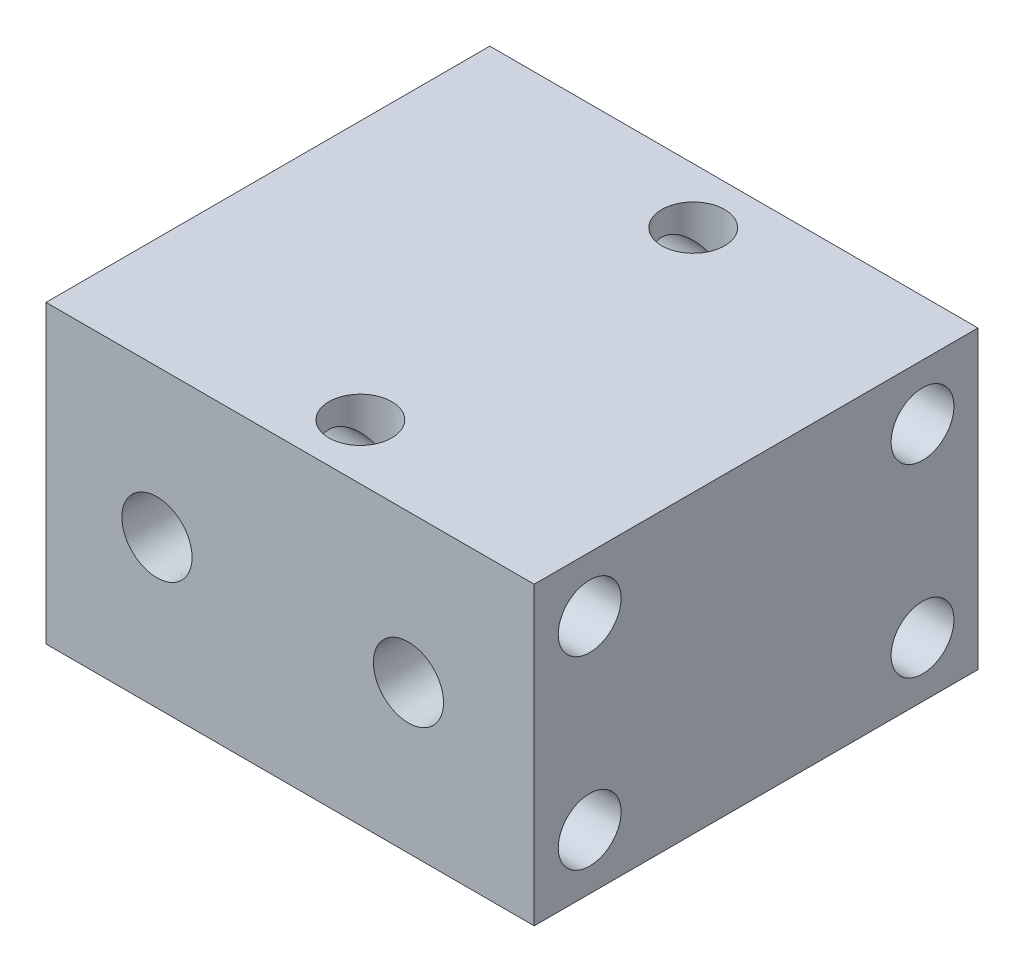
ISO-10303-21;
HEADER;
FILE_DESCRIPTION(('STEP AP214'),'2;1');
FILE_NAME('part.step','',(''),(''),'','','');
FILE_SCHEMA(('AUTOMOTIVE_DESIGN { 1 0 10303 214 1 1 1 1 }'));
ENDSEC;
DATA;
#1=APPLICATION_CONTEXT('core data for automotive mechanical design processes');
#2=APPLICATION_PROTOCOL_DEFINITION('international standard','automotive_design',2000,#1);
#3=PRODUCT_CONTEXT('',#1,'mechanical');
#4=PRODUCT('Part','Part','',(#3));
#5=PRODUCT_RELATED_PRODUCT_CATEGORY('part','',(#4));
#6=PRODUCT_DEFINITION_FORMATION('','',#4);
#7=PRODUCT_DEFINITION_CONTEXT('part definition',#1,'design');
#8=PRODUCT_DEFINITION('design','',#6,#7);
#9=PRODUCT_DEFINITION_SHAPE('','',#8);
#10=(LENGTH_UNIT() NAMED_UNIT(*) SI_UNIT(.MILLI.,.METRE.));
#11=(NAMED_UNIT(*) PLANE_ANGLE_UNIT() SI_UNIT($,.RADIAN.));
#12=(NAMED_UNIT(*) SI_UNIT($,.STERADIAN.) SOLID_ANGLE_UNIT());
#13=UNCERTAINTY_MEASURE_WITH_UNIT(LENGTH_MEASURE(1.E-05),#10,'distance_accuracy_value','');
#14=(GEOMETRIC_REPRESENTATION_CONTEXT(3) GLOBAL_UNCERTAINTY_ASSIGNED_CONTEXT((#13)) GLOBAL_UNIT_ASSIGNED_CONTEXT((#10,
#11,#12)) REPRESENTATION_CONTEXT('',''));
#15=CARTESIAN_POINT('',(0.,0.,0.));
#16=DIRECTION('',(0.,0.,1.));
#17=DIRECTION('',(1.,0.,0.));
#18=AXIS2_PLACEMENT_3D('',#15,#16,#17);
#19=CARTESIAN_POINT('',(2.00000000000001,40.,22.5));
#20=DIRECTION('',(0.,-1.,0.));
#21=DIRECTION('',(0.,0.,-1.));
#22=AXIS2_PLACEMENT_3D('',#19,#20,#21);
#23=CYLINDRICAL_SURFACE('',#22,4.25);
#24=CARTESIAN_POINT('',(2.00000000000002,7.49999999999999,22.5));
#25=DIRECTION('',(-0.707106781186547,-0.707106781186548,0.));
#26=DIRECTION('',(0.707106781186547,-0.707106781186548,0.));
#27=AXIS2_PLACEMENT_3D('',#24,#25,#26);
#28=ELLIPSE('',#27,6.01040764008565,4.25);
#29=CARTESIAN_POINT('',(2.00000000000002,7.49999999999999,18.25));
#30=VERTEX_POINT('',#29);
#31=CARTESIAN_POINT('',(2.00000000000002,7.49999999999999,26.75));
#32=VERTEX_POINT('',#31);
#33=EDGE_CURVE('E11',#30,#32,#28,.F.);
#34=ORIENTED_EDGE('',*,*,#33,.F.);
#35=CARTESIAN_POINT('',(2.00000000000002,7.49999999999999,22.5));
#36=DIRECTION('',(0.707106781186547,-0.707106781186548,0.));
#37=DIRECTION('',(-0.707106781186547,-0.707106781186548,0.));
#38=AXIS2_PLACEMENT_3D('',#35,#36,#37);
#39=ELLIPSE('',#38,6.01040764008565,4.25);
#40=EDGE_CURVE('E52',#32,#30,#39,.F.);
#41=ORIENTED_EDGE('',*,*,#40,.F.);
#42=EDGE_LOOP('',(#34,#41));
#43=FACE_BOUND('',#42,.T.);
#44=CARTESIAN_POINT('',(2.00000000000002,32.5,22.5));
#45=DIRECTION('',(-0.707106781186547,-0.707106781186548,0.));
#46=DIRECTION('',(0.707106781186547,-0.707106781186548,0.));
#47=AXIS2_PLACEMENT_3D('',#44,#45,#46);
#48=ELLIPSE('',#47,6.01040764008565,4.25);
#49=CARTESIAN_POINT('',(2.00000000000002,32.5,18.25));
#50=VERTEX_POINT('',#49);
#51=CARTESIAN_POINT('',(2.00000000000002,32.5,26.75));
#52=VERTEX_POINT('',#51);
#53=EDGE_CURVE('E121',#50,#52,#48,.T.);
#54=ORIENTED_EDGE('',*,*,#53,.F.);
#55=CARTESIAN_POINT('',(2.00000000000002,32.5,22.5));
#56=DIRECTION('',(0.707106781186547,-0.707106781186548,0.));
#57=DIRECTION('',(-0.707106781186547,-0.707106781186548,0.));
#58=AXIS2_PLACEMENT_3D('',#55,#56,#57);
#59=ELLIPSE('',#58,6.01040764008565,4.25);
#60=EDGE_CURVE('E123',#52,#50,#59,.T.);
#61=ORIENTED_EDGE('',*,*,#60,.F.);
#62=EDGE_LOOP('',(#54,#61));
#63=FACE_BOUND('',#62,.T.);
#64=ADVANCED_FACE('F38',(#43,#63),#23,.F.);
#65=CARTESIAN_POINT('',(2.00000000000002,32.5,22.5));
#66=DIRECTION('',(-0.707106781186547,-0.707106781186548,0.));
#67=DIRECTION('',(0.707106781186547,-0.707106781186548,0.));
#68=AXIS2_PLACEMENT_3D('',#65,#66,#67);
#69=ELLIPSE('',#68,6.01040764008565,4.25);
#70=EDGE_CURVE('E113',#50,#52,#69,.F.);
#71=ORIENTED_EDGE('',*,*,#70,.F.);
#72=CARTESIAN_POINT('',(2.00000000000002,32.5,22.5));
#73=DIRECTION('',(0.707106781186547,-0.707106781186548,0.));
#74=DIRECTION('',(-0.707106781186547,-0.707106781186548,0.));
#75=AXIS2_PLACEMENT_3D('',#72,#73,#74);
#76=ELLIPSE('',#75,6.01040764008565,4.25);
#77=EDGE_CURVE('E59',#52,#50,#76,.F.);
#78=ORIENTED_EDGE('',*,*,#77,.F.);
#79=EDGE_LOOP('',(#71,#78));
#80=FACE_BOUND('',#79,.T.);
#81=CARTESIAN_POINT('',(2.00000000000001,40.,22.5));
#82=DIRECTION('',(0.,1.,0.));
#83=DIRECTION('',(0.,0.,1.));
#84=AXIS2_PLACEMENT_3D('',#81,#82,#83);
#85=CIRCLE('',#84,4.25);
#86=CARTESIAN_POINT('',(2.00000000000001,40.,26.75));
#87=VERTEX_POINT('',#86);
#88=EDGE_CURVE('E191',#87,#87,#85,.T.);
#89=ORIENTED_EDGE('',*,*,#88,.T.);
#90=EDGE_LOOP('',(#89));
#91=FACE_BOUND('',#90,.T.);
#92=ADVANCED_FACE('F302',(#80,#91),#23,.F.);
#93=CARTESIAN_POINT('',(2.00000000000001,40.,-22.5));
#94=DIRECTION('',(0.,-1.,0.));
#95=DIRECTION('',(0.,0.,-1.));
#96=AXIS2_PLACEMENT_3D('',#93,#94,#95);
#97=CYLINDRICAL_SURFACE('',#96,4.25);
#98=CARTESIAN_POINT('',(2.00000000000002,7.49999999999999,-22.5));
#99=DIRECTION('',(-0.707106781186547,-0.707106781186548,0.));
#100=DIRECTION('',(0.707106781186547,-0.707106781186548,0.));
#101=AXIS2_PLACEMENT_3D('',#98,#99,#100);
#102=ELLIPSE('',#101,6.01040764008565,4.25);
#103=CARTESIAN_POINT('',(2.00000000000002,7.49999999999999,-26.75));
#104=VERTEX_POINT('',#103);
#105=CARTESIAN_POINT('',(2.00000000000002,7.49999999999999,-18.25));
#106=VERTEX_POINT('',#105);
#107=EDGE_CURVE('E126',#104,#106,#102,.F.);
#108=ORIENTED_EDGE('',*,*,#107,.F.);
#109=CARTESIAN_POINT('',(2.00000000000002,7.49999999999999,-22.5));
#110=DIRECTION('',(0.707106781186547,-0.707106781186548,0.));
#111=DIRECTION('',(-0.707106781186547,-0.707106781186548,0.));
#112=AXIS2_PLACEMENT_3D('',#109,#110,#111);
#113=ELLIPSE('',#112,6.01040764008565,4.25);
#114=EDGE_CURVE('E134',#106,#104,#113,.F.);
#115=ORIENTED_EDGE('',*,*,#114,.F.);
#116=EDGE_LOOP('',(#108,#115));
#117=FACE_BOUND('',#116,.T.);
#118=CARTESIAN_POINT('',(2.00000000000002,32.5,-22.5));
#119=DIRECTION('',(-0.707106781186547,-0.707106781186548,0.));
#120=DIRECTION('',(0.707106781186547,-0.707106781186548,0.));
#121=AXIS2_PLACEMENT_3D('',#118,#119,#120);
#122=ELLIPSE('',#121,6.01040764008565,4.25);
#123=CARTESIAN_POINT('',(2.00000000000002,32.5,-26.75));
#124=VERTEX_POINT('',#123);
#125=CARTESIAN_POINT('',(2.00000000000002,32.5,-18.25));
#126=VERTEX_POINT('',#125);
#127=EDGE_CURVE('E140',#124,#126,#122,.T.);
#128=ORIENTED_EDGE('',*,*,#127,.F.);
#129=CARTESIAN_POINT('',(2.00000000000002,32.5,-22.5));
#130=DIRECTION('',(0.707106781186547,-0.707106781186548,0.));
#131=DIRECTION('',(-0.707106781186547,-0.707106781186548,0.));
#132=AXIS2_PLACEMENT_3D('',#129,#130,#131);
#133=ELLIPSE('',#132,6.01040764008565,4.25);
#134=EDGE_CURVE('E143',#126,#124,#133,.T.);
#135=ORIENTED_EDGE('',*,*,#134,.F.);
#136=EDGE_LOOP('',(#128,#135));
#137=FACE_BOUND('',#136,.T.);
#138=ADVANCED_FACE('F307',(#117,#137),#97,.F.);
#139=CARTESIAN_POINT('',(2.00000000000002,32.5,-22.5));
#140=DIRECTION('',(-0.707106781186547,-0.707106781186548,0.));
#141=DIRECTION('',(0.707106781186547,-0.707106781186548,0.));
#142=AXIS2_PLACEMENT_3D('',#139,#140,#141);
#143=ELLIPSE('',#142,6.01040764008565,4.25);
#144=EDGE_CURVE('E137',#124,#126,#143,.F.);
#145=ORIENTED_EDGE('',*,*,#144,.F.);
#146=CARTESIAN_POINT('',(2.00000000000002,32.5,-22.5));
#147=DIRECTION('',(0.707106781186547,-0.707106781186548,0.));
#148=DIRECTION('',(-0.707106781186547,-0.707106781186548,0.));
#149=AXIS2_PLACEMENT_3D('',#146,#147,#148);
#150=ELLIPSE('',#149,6.01040764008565,4.25);
#151=EDGE_CURVE('E145',#126,#124,#150,.F.);
#152=ORIENTED_EDGE('',*,*,#151,.F.);
#153=EDGE_LOOP('',(#145,#152));
#154=FACE_BOUND('',#153,.T.);
#155=CARTESIAN_POINT('',(2.00000000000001,40.,-22.5));
#156=DIRECTION('',(0.,1.,0.));
#157=DIRECTION('',(0.,0.,1.));
#158=AXIS2_PLACEMENT_3D('',#155,#156,#157);
#159=CIRCLE('',#158,4.25);
#160=CARTESIAN_POINT('',(2.00000000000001,40.,-18.25));
#161=VERTEX_POINT('',#160);
#162=EDGE_CURVE('E180',#161,#161,#159,.T.);
#163=ORIENTED_EDGE('',*,*,#162,.T.);
#164=EDGE_LOOP('',(#163));
#165=FACE_BOUND('',#164,.T.);
#166=ADVANCED_FACE('F319',(#154,#165),#97,.F.);
#167=CARTESIAN_POINT('',(-33.,40.,-30.));
#168=DIRECTION('',(0.,1.,0.));
#169=DIRECTION('',(0.,0.,1.));
#170=AXIS2_PLACEMENT_3D('',#167,#168,#169);
#171=PLANE('',#170);
#172=ORIENTED_EDGE('',*,*,#162,.F.);
#173=EDGE_LOOP('',(#172));
#174=FACE_BOUND('',#173,.T.);
#175=DIRECTION('',(0.,0.,1.));
#176=VECTOR('',#175,1.);
#177=CARTESIAN_POINT('',(-33.,40.,-30.));
#178=LINE('',#177,#176);
#179=CARTESIAN_POINT('',(-33.,40.,-30.));
#180=VERTEX_POINT('',#179);
#181=CARTESIAN_POINT('',(-33.,40.,30.));
#182=VERTEX_POINT('',#181);
#183=EDGE_CURVE('E172',#180,#182,#178,.T.);
#184=ORIENTED_EDGE('',*,*,#183,.T.);
#185=DIRECTION('',(1.,0.,0.));
#186=VECTOR('',#185,1.);
#187=CARTESIAN_POINT('',(-33.,40.,30.));
#188=LINE('',#187,#186);
#189=CARTESIAN_POINT('',(33.,40.,30.));
#190=VERTEX_POINT('',#189);
#191=EDGE_CURVE('E184',#182,#190,#188,.T.);
#192=ORIENTED_EDGE('',*,*,#191,.T.);
#193=DIRECTION('',(0.,0.,-1.));
#194=VECTOR('',#193,1.);
#195=CARTESIAN_POINT('',(33.,40.,-30.));
#196=LINE('',#195,#194);
#197=CARTESIAN_POINT('',(33.,40.,-30.));
#198=VERTEX_POINT('',#197);
#199=EDGE_CURVE('E182',#190,#198,#196,.T.);
#200=ORIENTED_EDGE('',*,*,#199,.T.);
#201=DIRECTION('',(-1.,0.,0.));
#202=VECTOR('',#201,1.);
#203=CARTESIAN_POINT('',(-33.,40.,-30.));
#204=LINE('',#203,#202);
#205=EDGE_CURVE('E169',#198,#180,#204,.T.);
#206=ORIENTED_EDGE('',*,*,#205,.T.);
#207=EDGE_LOOP('',(#184,#192,#200,#206));
#208=FACE_BOUND('',#207,.T.);
#209=ORIENTED_EDGE('',*,*,#88,.F.);
#210=EDGE_LOOP('',(#209));
#211=FACE_BOUND('',#210,.T.);
#212=ADVANCED_FACE('F281',(#174,#208,#211),#171,.T.);
#213=CARTESIAN_POINT('',(-33.,0.,-30.));
#214=DIRECTION('',(0.,1.,0.));
#215=DIRECTION('',(0.,0.,1.));
#216=AXIS2_PLACEMENT_3D('',#213,#214,#215);
#217=PLANE('',#216);
#218=CARTESIAN_POINT('',(2.00000000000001,0.,-22.5));
#219=DIRECTION('',(0.,1.,0.));
#220=DIRECTION('',(0.,0.,1.));
#221=AXIS2_PLACEMENT_3D('',#218,#219,#220);
#222=CIRCLE('',#221,4.25);
#223=CARTESIAN_POINT('',(2.00000000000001,0.,-18.25));
#224=VERTEX_POINT('',#223);
#225=EDGE_CURVE('E188',#224,#224,#222,.T.);
#226=ORIENTED_EDGE('',*,*,#225,.T.);
#227=EDGE_LOOP('',(#226));
#228=FACE_BOUND('',#227,.T.);
#229=DIRECTION('',(0.,0.,1.));
#230=VECTOR('',#229,1.);
#231=CARTESIAN_POINT('',(-33.,0.,-30.));
#232=LINE('',#231,#230);
#233=CARTESIAN_POINT('',(-33.,0.,-30.));
#234=VERTEX_POINT('',#233);
#235=CARTESIAN_POINT('',(-33.,0.,30.));
#236=VERTEX_POINT('',#235);
#237=EDGE_CURVE('E177',#234,#236,#232,.T.);
#238=ORIENTED_EDGE('',*,*,#237,.F.);
#239=DIRECTION('',(-1.,0.,0.));
#240=VECTOR('',#239,1.);
#241=CARTESIAN_POINT('',(-33.,0.,-30.));
#242=LINE('',#241,#240);
#243=CARTESIAN_POINT('',(33.,0.,-30.));
#244=VERTEX_POINT('',#243);
#245=EDGE_CURVE('E170',#244,#234,#242,.T.);
#246=ORIENTED_EDGE('',*,*,#245,.F.);
#247=DIRECTION('',(0.,0.,-1.));
#248=VECTOR('',#247,1.);
#249=CARTESIAN_POINT('',(33.,0.,-30.));
#250=LINE('',#249,#248);
#251=CARTESIAN_POINT('',(33.,0.,30.));
#252=VERTEX_POINT('',#251);
#253=EDGE_CURVE('E173',#252,#244,#250,.T.);
#254=ORIENTED_EDGE('',*,*,#253,.F.);
#255=DIRECTION('',(1.,0.,0.));
#256=VECTOR('',#255,1.);
#257=CARTESIAN_POINT('',(-33.,0.,30.));
#258=LINE('',#257,#256);
#259=EDGE_CURVE('E175',#236,#252,#258,.T.);
#260=ORIENTED_EDGE('',*,*,#259,.F.);
#261=EDGE_LOOP('',(#238,#246,#254,#260));
#262=FACE_BOUND('',#261,.T.);
#263=CARTESIAN_POINT('',(2.00000000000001,0.,22.5));
#264=DIRECTION('',(0.,1.,0.));
#265=DIRECTION('',(0.,0.,1.));
#266=AXIS2_PLACEMENT_3D('',#263,#264,#265);
#267=CIRCLE('',#266,4.25);
#268=CARTESIAN_POINT('',(2.00000000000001,0.,26.75));
#269=VERTEX_POINT('',#268);
#270=EDGE_CURVE('E194',#269,#269,#267,.T.);
#271=ORIENTED_EDGE('',*,*,#270,.T.);
#272=EDGE_LOOP('',(#271));
#273=FACE_BOUND('',#272,.T.);
#274=ADVANCED_FACE('F260',(#228,#262,#273),#217,.F.);
#275=CARTESIAN_POINT('',(-33.,40.,-30.));
#276=DIRECTION('',(1.,0.,0.));
#277=DIRECTION('',(0.,0.,-1.));
#278=AXIS2_PLACEMENT_3D('',#275,#276,#277);
#279=PLANE('',#278);
#280=CARTESIAN_POINT('',(-33.,7.5,22.5));
#281=DIRECTION('',(-1.,0.,0.));
#282=DIRECTION('',(0.,0.,1.));
#283=AXIS2_PLACEMENT_3D('',#280,#281,#282);
#284=CIRCLE('',#283,4.25);
#285=CARTESIAN_POINT('',(-33.,7.5,26.75));
#286=VERTEX_POINT('',#285);
#287=EDGE_CURVE('E253',#286,#286,#284,.T.);
#288=ORIENTED_EDGE('',*,*,#287,.F.);
#289=EDGE_LOOP('',(#288));
#290=FACE_BOUND('',#289,.T.);
#291=CARTESIAN_POINT('',(-33.,32.5,22.5));
#292=DIRECTION('',(-1.,0.,0.));
#293=DIRECTION('',(0.,0.,1.));
#294=AXIS2_PLACEMENT_3D('',#291,#292,#293);
#295=CIRCLE('',#294,4.25);
#296=CARTESIAN_POINT('',(-33.,32.5,26.75));
#297=VERTEX_POINT('',#296);
#298=EDGE_CURVE('E247',#297,#297,#295,.T.);
#299=ORIENTED_EDGE('',*,*,#298,.F.);
#300=EDGE_LOOP('',(#299));
#301=FACE_BOUND('',#300,.T.);
#302=CARTESIAN_POINT('',(-33.,7.5,-22.5));
#303=DIRECTION('',(-1.,0.,0.));
#304=DIRECTION('',(0.,0.,1.));
#305=AXIS2_PLACEMENT_3D('',#302,#303,#304);
#306=CIRCLE('',#305,4.25);
#307=CARTESIAN_POINT('',(-33.,7.5,-18.25));
#308=VERTEX_POINT('',#307);
#309=EDGE_CURVE('E241',#308,#308,#306,.T.);
#310=ORIENTED_EDGE('',*,*,#309,.F.);
#311=EDGE_LOOP('',(#310));
#312=FACE_BOUND('',#311,.T.);
#313=CARTESIAN_POINT('',(-33.,32.5,-22.5));
#314=DIRECTION('',(-1.,0.,0.));
#315=DIRECTION('',(0.,0.,1.));
#316=AXIS2_PLACEMENT_3D('',#313,#314,#315);
#317=CIRCLE('',#316,4.25);
#318=CARTESIAN_POINT('',(-33.,32.5,-18.25));
#319=VERTEX_POINT('',#318);
#320=EDGE_CURVE('E235',#319,#319,#317,.T.);
#321=ORIENTED_EDGE('',*,*,#320,.F.);
#322=EDGE_LOOP('',(#321));
#323=FACE_BOUND('',#322,.T.);
#324=CARTESIAN_POINT('',(-33.,20.,0.));
#325=DIRECTION('',(-1.,0.,0.));
#326=DIRECTION('',(0.,0.,1.));
#327=AXIS2_PLACEMENT_3D('',#324,#325,#326);
#328=CIRCLE('',#327,0.5);
#329=CARTESIAN_POINT('',(-33.,20.,0.500000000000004));
#330=VERTEX_POINT('',#329);
#331=EDGE_CURVE('E200',#330,#330,#328,.T.);
#332=ORIENTED_EDGE('',*,*,#331,.F.);
#333=EDGE_LOOP('',(#332));
#334=FACE_BOUND('',#333,.T.);
#335=ORIENTED_EDGE('',*,*,#237,.T.);
#336=DIRECTION('',(0.,-1.,0.));
#337=VECTOR('',#336,1.);
#338=CARTESIAN_POINT('',(-33.,40.,30.));
#339=LINE('',#338,#337);
#340=EDGE_CURVE('E148',#182,#236,#339,.T.);
#341=ORIENTED_EDGE('',*,*,#340,.F.);
#342=ORIENTED_EDGE('',*,*,#183,.F.);
#343=DIRECTION('',(0.,-1.,0.));
#344=VECTOR('',#343,1.);
#345=CARTESIAN_POINT('',(-33.,40.,-30.));
#346=LINE('',#345,#344);
#347=EDGE_CURVE('E166',#180,#234,#346,.T.);
#348=ORIENTED_EDGE('',*,*,#347,.T.);
#349=EDGE_LOOP('',(#335,#341,#342,#348));
#350=FACE_BOUND('',#349,.T.);
#351=ADVANCED_FACE('F40',(#290,#301,#312,#323,#334,#350),#279,.F.);
#352=CARTESIAN_POINT('',(-33.,40.,30.));
#353=DIRECTION('',(0.,0.,-1.));
#354=DIRECTION('',(-1.,0.,0.));
#355=AXIS2_PLACEMENT_3D('',#352,#353,#354);
#356=PLANE('',#355);
#357=CARTESIAN_POINT('',(16.,20.,30.));
#358=DIRECTION('',(0.,0.,1.));
#359=DIRECTION('',(1.,0.,0.));
#360=AXIS2_PLACEMENT_3D('',#357,#358,#359);
#361=CIRCLE('',#360,4.744593);
#362=CARTESIAN_POINT('',(20.744593,20.,30.));
#363=VERTEX_POINT('',#362);
#364=EDGE_CURVE('E157',#363,#363,#361,.T.);
#365=ORIENTED_EDGE('',*,*,#364,.F.);
#366=EDGE_LOOP('',(#365));
#367=FACE_BOUND('',#366,.T.);
#368=CARTESIAN_POINT('',(-18.,20.,30.));
#369=DIRECTION('',(0.,0.,1.));
#370=DIRECTION('',(1.,0.,0.));
#371=AXIS2_PLACEMENT_3D('',#368,#369,#370);
#372=CIRCLE('',#371,4.744593);
#373=CARTESIAN_POINT('',(-13.255407,20.,30.));
#374=VERTEX_POINT('',#373);
#375=EDGE_CURVE('E214',#374,#374,#372,.T.);
#376=ORIENTED_EDGE('',*,*,#375,.F.);
#377=EDGE_LOOP('',(#376));
#378=FACE_BOUND('',#377,.T.);
#379=ORIENTED_EDGE('',*,*,#259,.T.);
#380=DIRECTION('',(0.,-1.,0.));
#381=VECTOR('',#380,1.);
#382=CARTESIAN_POINT('',(33.,40.,30.));
#383=LINE('',#382,#381);
#384=EDGE_CURVE('E160',#190,#252,#383,.T.);
#385=ORIENTED_EDGE('',*,*,#384,.F.);
#386=ORIENTED_EDGE('',*,*,#191,.F.);
#387=ORIENTED_EDGE('',*,*,#340,.T.);
#388=EDGE_LOOP('',(#379,#385,#386,#387));
#389=FACE_BOUND('',#388,.T.);
#390=ADVANCED_FACE('F259',(#367,#378,#389),#356,.F.);
#391=CARTESIAN_POINT('',(33.,40.,-30.));
#392=DIRECTION('',(-1.,0.,0.));
#393=DIRECTION('',(0.,0.,1.));
#394=AXIS2_PLACEMENT_3D('',#391,#392,#393);
#395=PLANE('',#394);
#396=CARTESIAN_POINT('',(33.,7.5,22.5));
#397=DIRECTION('',(-1.,0.,0.));
#398=DIRECTION('',(0.,0.,1.));
#399=AXIS2_PLACEMENT_3D('',#396,#397,#398);
#400=CIRCLE('',#399,4.25);
#401=CARTESIAN_POINT('',(33.,7.5,26.75));
#402=VERTEX_POINT('',#401);
#403=EDGE_CURVE('E250',#402,#402,#400,.F.);
#404=ORIENTED_EDGE('',*,*,#403,.F.);
#405=EDGE_LOOP('',(#404));
#406=FACE_BOUND('',#405,.T.);
#407=CARTESIAN_POINT('',(33.,32.5,22.5));
#408=DIRECTION('',(-1.,0.,0.));
#409=DIRECTION('',(0.,0.,1.));
#410=AXIS2_PLACEMENT_3D('',#407,#408,#409);
#411=CIRCLE('',#410,4.25);
#412=CARTESIAN_POINT('',(33.,32.5,26.75));
#413=VERTEX_POINT('',#412);
#414=EDGE_CURVE('E244',#413,#413,#411,.F.);
#415=ORIENTED_EDGE('',*,*,#414,.F.);
#416=EDGE_LOOP('',(#415));
#417=FACE_BOUND('',#416,.T.);
#418=CARTESIAN_POINT('',(33.,7.5,-22.5));
#419=DIRECTION('',(-1.,0.,0.));
#420=DIRECTION('',(0.,0.,1.));
#421=AXIS2_PLACEMENT_3D('',#418,#419,#420);
#422=CIRCLE('',#421,4.25);
#423=CARTESIAN_POINT('',(33.,7.5,-18.25));
#424=VERTEX_POINT('',#423);
#425=EDGE_CURVE('E238',#424,#424,#422,.F.);
#426=ORIENTED_EDGE('',*,*,#425,.F.);
#427=EDGE_LOOP('',(#426));
#428=FACE_BOUND('',#427,.T.);
#429=CARTESIAN_POINT('',(33.,32.5,-22.5));
#430=DIRECTION('',(-1.,0.,0.));
#431=DIRECTION('',(0.,0.,1.));
#432=AXIS2_PLACEMENT_3D('',#429,#430,#431);
#433=CIRCLE('',#432,4.25);
#434=CARTESIAN_POINT('',(33.,32.5,-18.25));
#435=VERTEX_POINT('',#434);
#436=EDGE_CURVE('E232',#435,#435,#433,.F.);
#437=ORIENTED_EDGE('',*,*,#436,.F.);
#438=EDGE_LOOP('',(#437));
#439=FACE_BOUND('',#438,.T.);
#440=ORIENTED_EDGE('',*,*,#253,.T.);
#441=DIRECTION('',(0.,-1.,0.));
#442=VECTOR('',#441,1.);
#443=CARTESIAN_POINT('',(33.,40.,-30.));
#444=LINE('',#443,#442);
#445=EDGE_CURVE('E163',#198,#244,#444,.T.);
#446=ORIENTED_EDGE('',*,*,#445,.F.);
#447=ORIENTED_EDGE('',*,*,#199,.F.);
#448=ORIENTED_EDGE('',*,*,#384,.T.);
#449=EDGE_LOOP('',(#440,#446,#447,#448));
#450=FACE_BOUND('',#449,.T.);
#451=ADVANCED_FACE('F288',(#406,#417,#428,#439,#450),#395,.F.);
#452=CARTESIAN_POINT('',(-33.,40.,-30.));
#453=DIRECTION('',(0.,0.,1.));
#454=DIRECTION('',(1.,0.,0.));
#455=AXIS2_PLACEMENT_3D('',#452,#453,#454);
#456=PLANE('',#455);
#457=ORIENTED_EDGE('',*,*,#245,.T.);
#458=ORIENTED_EDGE('',*,*,#347,.F.);
#459=ORIENTED_EDGE('',*,*,#205,.F.);
#460=ORIENTED_EDGE('',*,*,#445,.T.);
#461=EDGE_LOOP('',(#457,#458,#459,#460));
#462=FACE_BOUND('',#461,.T.);
#463=ADVANCED_FACE('F286',(#462),#456,.F.);
#464=CARTESIAN_POINT('',(2.00000000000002,7.49999999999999,-22.5));
#465=DIRECTION('',(-0.707106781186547,-0.707106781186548,0.));
#466=DIRECTION('',(0.707106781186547,-0.707106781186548,0.));
#467=AXIS2_PLACEMENT_3D('',#464,#465,#466);
#468=ELLIPSE('',#467,6.01040764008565,4.25);
#469=EDGE_CURVE('E129',#104,#106,#468,.T.);
#470=ORIENTED_EDGE('',*,*,#469,.F.);
#471=CARTESIAN_POINT('',(2.00000000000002,7.49999999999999,-22.5));
#472=DIRECTION('',(0.707106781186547,-0.707106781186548,0.));
#473=DIRECTION('',(-0.707106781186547,-0.707106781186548,0.));
#474=AXIS2_PLACEMENT_3D('',#471,#472,#473);
#475=ELLIPSE('',#474,6.01040764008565,4.25);
#476=EDGE_CURVE('E132',#106,#104,#475,.T.);
#477=ORIENTED_EDGE('',*,*,#476,.F.);
#478=EDGE_LOOP('',(#470,#477));
#479=FACE_BOUND('',#478,.T.);
#480=ORIENTED_EDGE('',*,*,#225,.F.);
#481=EDGE_LOOP('',(#480));
#482=FACE_BOUND('',#481,.T.);
#483=ADVANCED_FACE('F296',(#479,#482),#97,.F.);
#484=CARTESIAN_POINT('',(2.00000000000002,7.49999999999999,22.5));
#485=DIRECTION('',(-0.707106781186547,-0.707106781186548,0.));
#486=DIRECTION('',(0.707106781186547,-0.707106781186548,0.));
#487=AXIS2_PLACEMENT_3D('',#484,#485,#486);
#488=ELLIPSE('',#487,6.01040764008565,4.25);
#489=EDGE_CURVE('E46',#30,#32,#488,.T.);
#490=ORIENTED_EDGE('',*,*,#489,.F.);
#491=CARTESIAN_POINT('',(2.00000000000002,7.49999999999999,22.5));
#492=DIRECTION('',(0.707106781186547,-0.707106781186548,0.));
#493=DIRECTION('',(-0.707106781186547,-0.707106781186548,0.));
#494=AXIS2_PLACEMENT_3D('',#491,#492,#493);
#495=ELLIPSE('',#494,6.01040764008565,4.25);
#496=EDGE_CURVE('E104',#32,#30,#495,.T.);
#497=ORIENTED_EDGE('',*,*,#496,.F.);
#498=EDGE_LOOP('',(#490,#497));
#499=FACE_BOUND('',#498,.T.);
#500=ORIENTED_EDGE('',*,*,#270,.F.);
#501=EDGE_LOOP('',(#500));
#502=FACE_BOUND('',#501,.T.);
#503=ADVANCED_FACE('F116',(#499,#502),#23,.F.);
#504=CARTESIAN_POINT('',(-23.,20.,0.));
#505=DIRECTION('',(-1.,0.,0.));
#506=DIRECTION('',(0.,0.,1.));
#507=AXIS2_PLACEMENT_3D('',#504,#505,#506);
#508=CYLINDRICAL_SURFACE('',#507,0.5);
#509=CARTESIAN_POINT('',(-23.,20.,0.));
#510=DIRECTION('',(-1.,0.,0.));
#511=DIRECTION('',(0.,0.,1.));
#512=AXIS2_PLACEMENT_3D('',#509,#510,#511);
#513=CIRCLE('',#512,0.5);
#514=CARTESIAN_POINT('',(-23.,20.,0.500000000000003));
#515=VERTEX_POINT('',#514);
#516=EDGE_CURVE('E197',#515,#515,#513,.T.);
#517=ORIENTED_EDGE('',*,*,#516,.F.);
#518=EDGE_LOOP('',(#517));
#519=FACE_BOUND('',#518,.T.);
#520=ORIENTED_EDGE('',*,*,#331,.T.);
#521=EDGE_LOOP('',(#520));
#522=FACE_BOUND('',#521,.T.);
#523=ADVANCED_FACE('F311',(#519,#522),#508,.F.);
#524=CARTESIAN_POINT('',(-23.,20.,0.));
#525=DIRECTION('',(-1.,0.,0.));
#526=DIRECTION('',(0.,0.,1.));
#527=AXIS2_PLACEMENT_3D('',#524,#525,#526);
#528=PLANE('',#527);
#529=ORIENTED_EDGE('',*,*,#516,.T.);
#530=EDGE_LOOP('',(#529));
#531=FACE_BOUND('',#530,.T.);
#532=ADVANCED_FACE('F316',(#531),#528,.T.);
#533=CARTESIAN_POINT('',(-18.,20.,18.38));
#534=DIRECTION('',(0.,0.,1.));
#535=DIRECTION('',(1.,0.,0.));
#536=AXIS2_PLACEMENT_3D('',#533,#534,#535);
#537=CONICAL_SURFACE('',#536,4.21640000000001,1.02974425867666);
#538=CARTESIAN_POINT('',(-18.,20.,17.0482525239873));
#539=DIRECTION('',(0.,0.,1.));
#540=DIRECTION('',(1.,0.,0.));
#541=AXIS2_PLACEMENT_3D('',#538,#539,#540);
#542=CIRCLE('',#541,2.);
#543=CARTESIAN_POINT('',(-16.,20.,17.0482525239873));
#544=VERTEX_POINT('',#543);
#545=EDGE_CURVE('E154',#544,#544,#542,.F.);
#546=ORIENTED_EDGE('',*,*,#545,.T.);
#547=EDGE_LOOP('',(#546));
#548=FACE_BOUND('',#547,.T.);
#549=CARTESIAN_POINT('',(-18.,20.,18.38));
#550=DIRECTION('',(0.,0.,1.));
#551=DIRECTION('',(1.,0.,0.));
#552=AXIS2_PLACEMENT_3D('',#549,#550,#551);
#553=CIRCLE('',#552,4.21640000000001);
#554=CARTESIAN_POINT('',(-13.7836,20.,18.38));
#555=VERTEX_POINT('',#554);
#556=EDGE_CURVE('E203',#555,#555,#553,.T.);
#557=ORIENTED_EDGE('',*,*,#556,.T.);
#558=EDGE_LOOP('',(#557));
#559=FACE_BOUND('',#558,.T.);
#560=ADVANCED_FACE('F399',(#548,#559),#537,.F.);
#561=CARTESIAN_POINT('',(-18.,20.,30.));
#562=DIRECTION('',(0.,0.,1.));
#563=DIRECTION('',(1.,0.,0.));
#564=AXIS2_PLACEMENT_3D('',#561,#562,#563);
#565=CYLINDRICAL_SURFACE('',#564,4.21640000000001);
#566=ORIENTED_EDGE('',*,*,#556,.F.);
#567=EDGE_LOOP('',(#566));
#568=FACE_BOUND('',#567,.T.);
#569=CARTESIAN_POINT('',(-18.,20.,23.08));
#570=DIRECTION('',(0.,0.,1.));
#571=DIRECTION('',(1.,0.,0.));
#572=AXIS2_PLACEMENT_3D('',#569,#570,#571);
#573=CIRCLE('',#572,4.2164);
#574=CARTESIAN_POINT('',(-13.7836,20.,23.08));
#575=VERTEX_POINT('',#574);
#576=EDGE_CURVE('E208',#575,#575,#573,.T.);
#577=ORIENTED_EDGE('',*,*,#576,.T.);
#578=EDGE_LOOP('',(#577));
#579=FACE_BOUND('',#578,.T.);
#580=ADVANCED_FACE('F395',(#568,#579),#565,.F.);
#581=CARTESIAN_POINT('',(-13.7836,20.,23.08));
#582=DIRECTION('',(0.,0.,-1.));
#583=DIRECTION('',(-1.,0.,0.));
#584=AXIS2_PLACEMENT_3D('',#581,#582,#583);
#585=PLANE('',#584);
#586=ORIENTED_EDGE('',*,*,#576,.F.);
#587=EDGE_LOOP('',(#586));
#588=FACE_BOUND('',#587,.T.);
#589=CARTESIAN_POINT('',(-18.,20.,23.08));
#590=DIRECTION('',(0.,0.,1.));
#591=DIRECTION('',(1.,0.,0.));
#592=AXIS2_PLACEMENT_3D('',#589,#590,#591);
#593=CIRCLE('',#592,4.53739893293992);
#594=CARTESIAN_POINT('',(-13.4626010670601,20.,23.08));
#595=VERTEX_POINT('',#594);
#596=EDGE_CURVE('E211',#595,#595,#593,.T.);
#597=ORIENTED_EDGE('',*,*,#596,.T.);
#598=EDGE_LOOP('',(#597));
#599=FACE_BOUND('',#598,.T.);
#600=ADVANCED_FACE('F391',(#588,#599),#585,.F.);
#601=CARTESIAN_POINT('',(-18.,20.,30.));
#602=DIRECTION('',(0.,0.,1.));
#603=DIRECTION('',(1.,0.,0.));
#604=AXIS2_PLACEMENT_3D('',#601,#602,#603);
#605=CONICAL_SURFACE('',#604,4.744593,0.0299323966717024);
#606=ORIENTED_EDGE('',*,*,#596,.F.);
#607=EDGE_LOOP('',(#606));
#608=FACE_BOUND('',#607,.T.);
#609=ORIENTED_EDGE('',*,*,#375,.T.);
#610=EDGE_LOOP('',(#609));
#611=FACE_BOUND('',#610,.T.);
#612=ADVANCED_FACE('F387',(#608,#611),#605,.F.);
#613=CARTESIAN_POINT('',(16.,20.,18.38));
#614=DIRECTION('',(0.,0.,1.));
#615=DIRECTION('',(1.,0.,0.));
#616=AXIS2_PLACEMENT_3D('',#613,#614,#615);
#617=CONICAL_SURFACE('',#616,4.21640000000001,1.02974425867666);
#618=CARTESIAN_POINT('',(16.,20.,17.0482525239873));
#619=DIRECTION('',(0.,0.,1.));
#620=DIRECTION('',(1.,0.,0.));
#621=AXIS2_PLACEMENT_3D('',#618,#619,#620);
#622=CIRCLE('',#621,2.);
#623=CARTESIAN_POINT('',(18.,20.,17.0482525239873));
#624=VERTEX_POINT('',#623);
#625=EDGE_CURVE('E149',#624,#624,#622,.F.);
#626=ORIENTED_EDGE('',*,*,#625,.T.);
#627=EDGE_LOOP('',(#626));
#628=FACE_BOUND('',#627,.T.);
#629=CARTESIAN_POINT('',(16.,20.,18.38));
#630=DIRECTION('',(0.,0.,1.));
#631=DIRECTION('',(1.,0.,0.));
#632=AXIS2_PLACEMENT_3D('',#629,#630,#631);
#633=CIRCLE('',#632,4.21640000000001);
#634=CARTESIAN_POINT('',(20.2164,20.,18.38));
#635=VERTEX_POINT('',#634);
#636=EDGE_CURVE('E217',#635,#635,#633,.T.);
#637=ORIENTED_EDGE('',*,*,#636,.T.);
#638=EDGE_LOOP('',(#637));
#639=FACE_BOUND('',#638,.T.);
#640=ADVANCED_FACE('F383',(#628,#639),#617,.F.);
#641=CARTESIAN_POINT('',(16.,20.,30.));
#642=DIRECTION('',(0.,0.,1.));
#643=DIRECTION('',(1.,0.,0.));
#644=AXIS2_PLACEMENT_3D('',#641,#642,#643);
#645=CYLINDRICAL_SURFACE('',#644,4.21640000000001);
#646=ORIENTED_EDGE('',*,*,#636,.F.);
#647=EDGE_LOOP('',(#646));
#648=FACE_BOUND('',#647,.T.);
#649=CARTESIAN_POINT('',(16.,20.,23.08));
#650=DIRECTION('',(0.,0.,1.));
#651=DIRECTION('',(1.,0.,0.));
#652=AXIS2_PLACEMENT_3D('',#649,#650,#651);
#653=CIRCLE('',#652,4.2164);
#654=CARTESIAN_POINT('',(20.2164,20.,23.08));
#655=VERTEX_POINT('',#654);
#656=EDGE_CURVE('E220',#655,#655,#653,.T.);
#657=ORIENTED_EDGE('',*,*,#656,.T.);
#658=EDGE_LOOP('',(#657));
#659=FACE_BOUND('',#658,.T.);
#660=ADVANCED_FACE('F379',(#648,#659),#645,.F.);
#661=CARTESIAN_POINT('',(20.2164,20.,23.08));
#662=DIRECTION('',(0.,0.,-1.));
#663=DIRECTION('',(-1.,0.,0.));
#664=AXIS2_PLACEMENT_3D('',#661,#662,#663);
#665=PLANE('',#664);
#666=ORIENTED_EDGE('',*,*,#656,.F.);
#667=EDGE_LOOP('',(#666));
#668=FACE_BOUND('',#667,.T.);
#669=CARTESIAN_POINT('',(16.,20.,23.08));
#670=DIRECTION('',(0.,0.,1.));
#671=DIRECTION('',(1.,0.,0.));
#672=AXIS2_PLACEMENT_3D('',#669,#670,#671);
#673=CIRCLE('',#672,4.53739893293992);
#674=CARTESIAN_POINT('',(20.5373989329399,20.,23.08));
#675=VERTEX_POINT('',#674);
#676=EDGE_CURVE('E223',#675,#675,#673,.T.);
#677=ORIENTED_EDGE('',*,*,#676,.T.);
#678=EDGE_LOOP('',(#677));
#679=FACE_BOUND('',#678,.T.);
#680=ADVANCED_FACE('F375',(#668,#679),#665,.F.);
#681=CARTESIAN_POINT('',(16.,20.,30.));
#682=DIRECTION('',(0.,0.,1.));
#683=DIRECTION('',(1.,0.,0.));
#684=AXIS2_PLACEMENT_3D('',#681,#682,#683);
#685=CONICAL_SURFACE('',#684,4.744593,0.0299323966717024);
#686=ORIENTED_EDGE('',*,*,#676,.F.);
#687=EDGE_LOOP('',(#686));
#688=FACE_BOUND('',#687,.T.);
#689=ORIENTED_EDGE('',*,*,#364,.T.);
#690=EDGE_LOOP('',(#689));
#691=FACE_BOUND('',#690,.T.);
#692=ADVANCED_FACE('F371',(#688,#691),#685,.F.);
#693=CARTESIAN_POINT('',(-18.,20.,9.99999999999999));
#694=DIRECTION('',(0.,0.,1.));
#695=DIRECTION('',(1.,0.,0.));
#696=AXIS2_PLACEMENT_3D('',#693,#694,#695);
#697=CYLINDRICAL_SURFACE('',#696,2.);
#698=CARTESIAN_POINT('',(-18.,20.,9.99999999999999));
#699=DIRECTION('',(0.,0.,1.));
#700=DIRECTION('',(1.,0.,0.));
#701=AXIS2_PLACEMENT_3D('',#698,#699,#700);
#702=CIRCLE('',#701,2.);
#703=CARTESIAN_POINT('',(-16.,20.,9.99999999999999));
#704=VERTEX_POINT('',#703);
#705=EDGE_CURVE('E152',#704,#704,#702,.T.);
#706=ORIENTED_EDGE('',*,*,#705,.F.);
#707=EDGE_LOOP('',(#706));
#708=FACE_BOUND('',#707,.T.);
#709=ORIENTED_EDGE('',*,*,#545,.F.);
#710=EDGE_LOOP('',(#709));
#711=FACE_BOUND('',#710,.T.);
#712=ADVANCED_FACE('F367',(#708,#711),#697,.F.);
#713=CARTESIAN_POINT('',(-18.,20.,9.99999999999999));
#714=DIRECTION('',(0.,0.,1.));
#715=DIRECTION('',(1.,0.,0.));
#716=AXIS2_PLACEMENT_3D('',#713,#714,#715);
#717=PLANE('',#716);
#718=ORIENTED_EDGE('',*,*,#705,.T.);
#719=EDGE_LOOP('',(#718));
#720=FACE_BOUND('',#719,.T.);
#721=ADVANCED_FACE('F363',(#720),#717,.T.);
#722=CARTESIAN_POINT('',(16.,20.,9.99999999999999));
#723=DIRECTION('',(0.,0.,1.));
#724=DIRECTION('',(1.,0.,0.));
#725=AXIS2_PLACEMENT_3D('',#722,#723,#724);
#726=CYLINDRICAL_SURFACE('',#725,2.);
#727=CARTESIAN_POINT('',(16.,20.,9.99999999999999));
#728=DIRECTION('',(0.,0.,1.));
#729=DIRECTION('',(1.,0.,0.));
#730=AXIS2_PLACEMENT_3D('',#727,#728,#729);
#731=CIRCLE('',#730,2.);
#732=CARTESIAN_POINT('',(18.,20.,9.99999999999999));
#733=VERTEX_POINT('',#732);
#734=EDGE_CURVE('E153',#733,#733,#731,.T.);
#735=ORIENTED_EDGE('',*,*,#734,.F.);
#736=EDGE_LOOP('',(#735));
#737=FACE_BOUND('',#736,.T.);
#738=ORIENTED_EDGE('',*,*,#625,.F.);
#739=EDGE_LOOP('',(#738));
#740=FACE_BOUND('',#739,.T.);
#741=ADVANCED_FACE('F354',(#737,#740),#726,.F.);
#742=CARTESIAN_POINT('',(16.,20.,9.99999999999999));
#743=DIRECTION('',(0.,0.,1.));
#744=DIRECTION('',(1.,0.,0.));
#745=AXIS2_PLACEMENT_3D('',#742,#743,#744);
#746=PLANE('',#745);
#747=ORIENTED_EDGE('',*,*,#734,.T.);
#748=EDGE_LOOP('',(#747));
#749=FACE_BOUND('',#748,.T.);
#750=ADVANCED_FACE('F345',(#749),#746,.T.);
#751=CARTESIAN_POINT('',(45.0208152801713,32.5,-22.5));
#752=DIRECTION('',(-1.,0.,0.));
#753=DIRECTION('',(0.,0.,1.));
#754=AXIS2_PLACEMENT_3D('',#751,#752,#753);
#755=CYLINDRICAL_SURFACE('',#754,4.25);
#756=ORIENTED_EDGE('',*,*,#127,.T.);
#757=ORIENTED_EDGE('',*,*,#151,.T.);
#758=EDGE_LOOP('',(#756,#757));
#759=FACE_BOUND('',#758,.T.);
#760=ORIENTED_EDGE('',*,*,#436,.T.);
#761=EDGE_LOOP('',(#760));
#762=FACE_BOUND('',#761,.T.);
#763=ADVANCED_FACE('F341',(#759,#762),#755,.F.);
#764=ORIENTED_EDGE('',*,*,#144,.T.);
#765=ORIENTED_EDGE('',*,*,#134,.T.);
#766=EDGE_LOOP('',(#764,#765));
#767=FACE_BOUND('',#766,.T.);
#768=ORIENTED_EDGE('',*,*,#320,.T.);
#769=EDGE_LOOP('',(#768));
#770=FACE_BOUND('',#769,.T.);
#771=ADVANCED_FACE('F344',(#767,#770),#755,.F.);
#772=CARTESIAN_POINT('',(45.0208152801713,7.5,-22.5));
#773=DIRECTION('',(-1.,0.,0.));
#774=DIRECTION('',(0.,0.,1.));
#775=AXIS2_PLACEMENT_3D('',#772,#773,#774);
#776=CYLINDRICAL_SURFACE('',#775,4.25);
#777=ORIENTED_EDGE('',*,*,#469,.T.);
#778=ORIENTED_EDGE('',*,*,#114,.T.);
#779=EDGE_LOOP('',(#777,#778));
#780=FACE_BOUND('',#779,.T.);
#781=ORIENTED_EDGE('',*,*,#425,.T.);
#782=EDGE_LOOP('',(#781));
#783=FACE_BOUND('',#782,.T.);
#784=ADVANCED_FACE('F353',(#780,#783),#776,.F.);
#785=ORIENTED_EDGE('',*,*,#107,.T.);
#786=ORIENTED_EDGE('',*,*,#476,.T.);
#787=EDGE_LOOP('',(#785,#786));
#788=FACE_BOUND('',#787,.T.);
#789=ORIENTED_EDGE('',*,*,#309,.T.);
#790=EDGE_LOOP('',(#789));
#791=FACE_BOUND('',#790,.T.);
#792=ADVANCED_FACE('F358',(#788,#791),#776,.F.);
#793=CARTESIAN_POINT('',(45.0208152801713,32.5,22.5));
#794=DIRECTION('',(-1.,0.,0.));
#795=DIRECTION('',(0.,0.,1.));
#796=AXIS2_PLACEMENT_3D('',#793,#794,#795);
#797=CYLINDRICAL_SURFACE('',#796,4.25);
#798=ORIENTED_EDGE('',*,*,#53,.T.);
#799=ORIENTED_EDGE('',*,*,#77,.T.);
#800=EDGE_LOOP('',(#798,#799));
#801=FACE_BOUND('',#800,.T.);
#802=ORIENTED_EDGE('',*,*,#414,.T.);
#803=EDGE_LOOP('',(#802));
#804=FACE_BOUND('',#803,.T.);
#805=ADVANCED_FACE('F534',(#801,#804),#797,.F.);
#806=ORIENTED_EDGE('',*,*,#70,.T.);
#807=ORIENTED_EDGE('',*,*,#60,.T.);
#808=EDGE_LOOP('',(#806,#807));
#809=FACE_BOUND('',#808,.T.);
#810=ORIENTED_EDGE('',*,*,#298,.T.);
#811=EDGE_LOOP('',(#810));
#812=FACE_BOUND('',#811,.T.);
#813=ADVANCED_FACE('F543',(#809,#812),#797,.F.);
#814=CARTESIAN_POINT('',(45.0208152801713,7.5,22.5));
#815=DIRECTION('',(-1.,0.,0.));
#816=DIRECTION('',(0.,0.,1.));
#817=AXIS2_PLACEMENT_3D('',#814,#815,#816);
#818=CYLINDRICAL_SURFACE('',#817,4.25);
#819=ORIENTED_EDGE('',*,*,#489,.T.);
#820=ORIENTED_EDGE('',*,*,#40,.T.);
#821=EDGE_LOOP('',(#819,#820));
#822=FACE_BOUND('',#821,.T.);
#823=ORIENTED_EDGE('',*,*,#403,.T.);
#824=EDGE_LOOP('',(#823));
#825=FACE_BOUND('',#824,.T.);
#826=ADVANCED_FACE('F111',(#822,#825),#818,.F.);
#827=ORIENTED_EDGE('',*,*,#33,.T.);
#828=ORIENTED_EDGE('',*,*,#496,.T.);
#829=EDGE_LOOP('',(#827,#828));
#830=FACE_BOUND('',#829,.T.);
#831=ORIENTED_EDGE('',*,*,#287,.T.);
#832=EDGE_LOOP('',(#831));
#833=FACE_BOUND('',#832,.T.);
#834=ADVANCED_FACE('F105',(#830,#833),#818,.F.);
#835=CLOSED_SHELL('',(#64,#92,#138,#166,#212,#274,#351,#390,#451,#463,#483,#503,#523,#532,#560,
#580,#600,#612,#640,#660,#680,#692,#712,#721,#741,#750,#763,#771,#784,#792,#805,#813,#826,#834));
#836=MANIFOLD_SOLID_BREP('B2',#835);
#837=ADVANCED_BREP_SHAPE_REPRESENTATION('',(#18,#836),#14);
#838=SHAPE_DEFINITION_REPRESENTATION(#9,#837);
ENDSEC;
END-ISO-10303-21;
